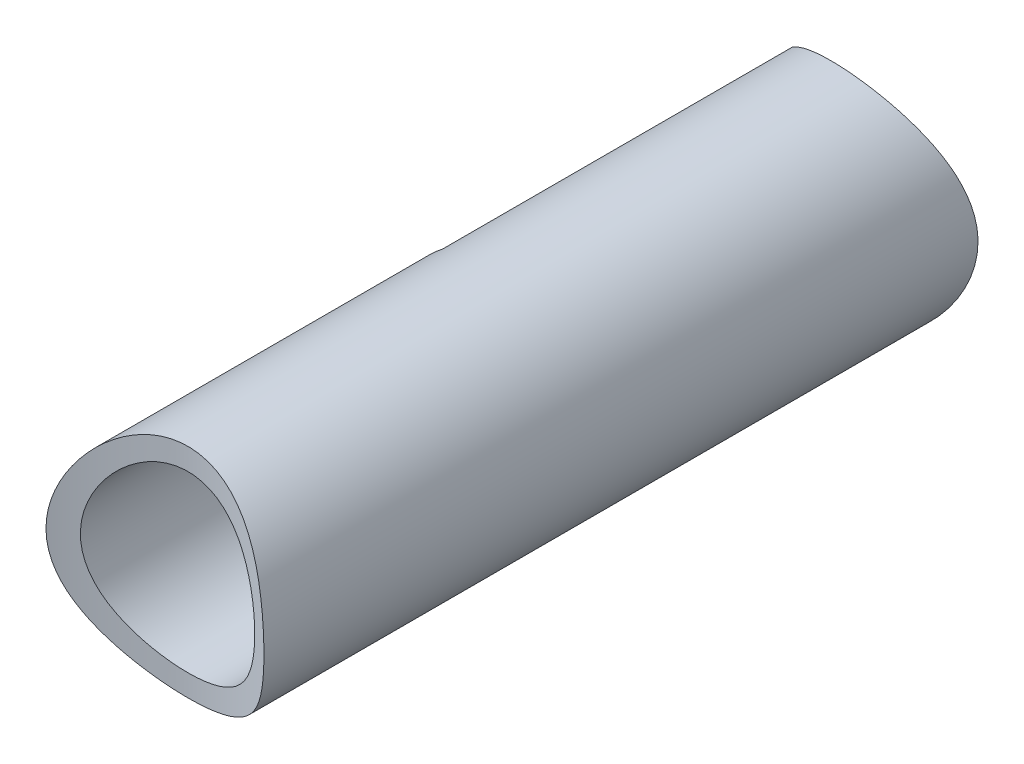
from build123d import *

# Parameters (mm, degrees)
SKETCH1_R               = 15.875
SKETCH1_R_2             = 12.7
BOSS_EXTRUDE1_DEPTH     = 152.5524
CUT_EXTRUDE1_START      = -9.525
SKETCH2_R               = 77.7875
CUT_EXTRUDE1_DEPTH      = 203.2
CUT_EXTRUDE2_DEPTH      = 155.195544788
CUT_EXTRUDE2_DEPTH_BACK = 155.195544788
SKETCH3_R               = 28.575


with BuildPart() as part:
    # Sketch1 → Boss-Extrude1 (new body)
    with BuildSketch(Plane.XY):
        Circle(SKETCH1_R)
        Circle(SKETCH1_R_2, mode=Mode.SUBTRACT)
    extrude(amount=-BOSS_EXTRUDE1_DEPTH)

    # Sketch2 → Cut-Extrude1 (cut)
    with BuildSketch(Plane(origin=(0, 0, 0), x_dir=(0, 0, -1), z_dir=(1, 0, 0)).offset(CUT_EXTRUDE1_START)):
        with Locations((152.4, 3.175)):
            Circle(SKETCH2_R)
    extrude(amount=-CUT_EXTRUDE1_DEPTH, mode=Mode.SUBTRACT)

    # Sketch3 → Cut-Extrude2 (cut, two sides: drawn at the far end of the back side and taken through both)
    with BuildSketch(Plane(origin=(0, 0, 0), x_dir=(1, 0, 0), z_dir=(0, 1, 0)).offset(-CUT_EXTRUDE2_DEPTH_BACK)):
        with Locations((1.5875, 152.5524)):
            Circle(SKETCH3_R)
        Circle(SKETCH3_R)
    extrude(amount=CUT_EXTRUDE2_DEPTH + CUT_EXTRUDE2_DEPTH_BACK, mode=Mode.SUBTRACT)


solid = part.part
